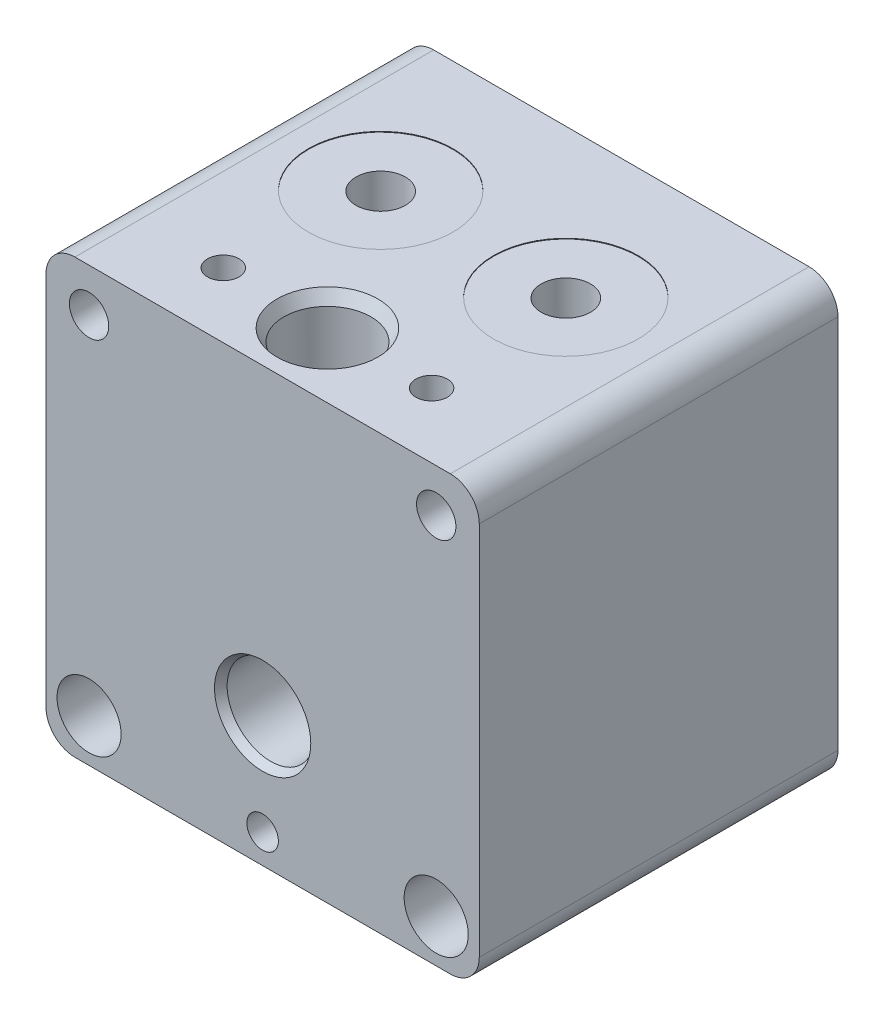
from build123d import *

# Parameters (mm, degrees)
BASE_EXTRUDE_DEPTH       = 39.37
FILLET2_R                = 3.175
SKETCH19_R               = 1.7272
F_8_32_HOLES_DEPTH       = 7.62
SKETCH3_R                = 2.159
CORNER_THRU_HOLES_DEPTH  = 52.772976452
SKETCH4_R                = 3.5179
CORNER_CBORE_DEPTH       = 7.62
SKETCH10_R               = 3.2385
SENSORS_THRU_HOLES_DEPTH = 52.772976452
SKETCH13_R               = 4.7752
TEMP_CBORE_DEPTH         = 11.684
SKETCH15_R               = 17.399
CAVITY_CBORE_DEPTH       = 22.352
SKETCH16_R               = 17.4625
BORE_ORING_DEPTH         = 12.7
CHAMFER2_SIZE            = 0.508
CHAMFER2_SIZE2           = 0.87988181
SKETCH23_R               = 2.7051
UW_CONN_THRU_DEPTH       = 22.86
SKETCH24_R               = 7.9375
UW_SPOTFACE_DEPTH        = 0.0762
SKETCH28_R               = 3.175
COND_RA_DRILL_DEPTH      = 12.7
SKETCH29_R               = 2.7051
UW2_THRU_DEPTH           = 22.86
SKETCH30_R               = 7.9375
UW2_LAND_DEPTH           = 0.0762
SKETCH31_R               = 1.7272
CND_KEEPER_HOLES_DEPTH   = 12.7
SKETCH32_R               = 2.413
CND_THRU_HOLE_DEPTH      = 20.32
SKETCH33_R               = 4.7752
CND_CBORE_DEPTH          = 13.716
CND_CHAMFER_SIZE         = 0.762
CND_CHAMFER_SIZE2        = 1.319822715
SKETCH34_R               = 21.336
ENDCAP_LAND_DEPTH        = 3.81
ENDCAP_CHAMFER_SIZE      = 0.508
ENDCAP_CHAMFER_SIZE2     = 0.87988181
SKETCH35_R               = 2.159
AFT_GUARD_HOLES_DEPTH    = 31.75
SKETCH36_R               = 1.1303
PLATE_HOLES_DEPTH        = 30.48


with BuildPart() as part:
    # Sketch1 → Base-Extrude (new body)
    with BuildSketch(Plane.XY):
        Polygon((23.7744, 0), (23.7744, 23.7744), (-23.7744, 23.7744), (-23.7744, -23.7744), (23.7744, -23.7744), align=None)
    extrude(amount=BASE_EXTRUDE_DEPTH)

    # Fillet2
    fillet2_edges = [part.edges().sort_by_distance(p)[0] for p in [
        (23.7744, -23.7744, 19.685),
        (-23.7744, -23.7744, 19.685),
        (-23.7744, 23.7744, 19.685),
        (23.7744, 23.7744, 19.685),
    ]]
    fillet(fillet2_edges, radius=FILLET2_R)

    # Sketch19 → 8_32_holes (cut)
    with BuildSketch(Plane.XY.offset(39.37)):
        with Locations((0, -20.574)):
            Circle(SKETCH19_R)
    extrude(amount=-F_8_32_HOLES_DEPTH, mode=Mode.SUBTRACT)

    # Sketch3 → corner_thru_holes (cut, through all)
    with BuildSketch(Plane.XY.offset(39.37)):
        with Locations((-19.05, -19.05)):
            Circle(SKETCH3_R)
        with Locations(Location((19.05, -19.05, 0), (0, 0, 180))):
            Circle(SKETCH3_R)
    extrude(amount=-CORNER_THRU_HOLES_DEPTH, mode=Mode.SUBTRACT)

    # Sketch4 → corner_cbore (cut)
    with BuildSketch(Plane.XY.offset(39.37)):
        with Locations((-19.05, -19.05)):
            Circle(SKETCH4_R)
        with Locations((19.05, -19.05)):
            Circle(SKETCH4_R)
    extrude(amount=-CORNER_CBORE_DEPTH, mode=Mode.SUBTRACT)

    # Sketch10 → sensors_thru_holes (cut, through all)
    with BuildSketch(Plane.XY.offset(39.37)):
        with Locations(Location((0, -9.525, 0), (0, 0, 180))):
            Circle(SKETCH10_R)
    extrude(amount=-SENSORS_THRU_HOLES_DEPTH, mode=Mode.SUBTRACT)

    # Sketch13 → temp_cbore (cut)
    with BuildSketch(Plane.XY.offset(39.37)):
        with Locations((0, -9.525)):
            Circle(SKETCH13_R)
    extrude(amount=-TEMP_CBORE_DEPTH, mode=Mode.SUBTRACT)

    # Sketch15 → cavity_cbore (cut)
    with BuildSketch(Plane(origin=(0, 0, 0), x_dir=(-1, 0, 0), z_dir=(0, 0, -1))):
        Circle(SKETCH15_R)
    extrude(amount=-CAVITY_CBORE_DEPTH, mode=Mode.SUBTRACT)

    # Sketch16 → bore_oring (cut)
    with BuildSketch(Plane(origin=(0, 0, 0), x_dir=(-1, 0, 0), z_dir=(0, 0, -1))):
        Circle(SKETCH16_R)
    extrude(amount=-BORE_ORING_DEPTH, mode=Mode.SUBTRACT)

    # Chamfer2
    chamfer2_edges = [part.edges().sort_by_distance(p)[0] for p in [
        (-4.7752, -9.525, 39.37),
    ]]
    chamfer2_side = [part.faces().sort_by_distance(p)[0] for p in [
        (0, 1.1256211, 39.37),
    ]]
    chamfer(chamfer2_edges, length=CHAMFER2_SIZE, length2=CHAMFER2_SIZE2, reference=chamfer2_side[0])

    # Sketch23 → uw_conn_thru (cut)
    with BuildSketch(Plane(origin=(0, 23.7744, 0), x_dir=(-1, 0, 0), z_dir=(0, 1, 0))):
        with Locations((10.16, 16.256)):
            Circle(SKETCH23_R)
    extrude(amount=-UW_CONN_THRU_DEPTH, mode=Mode.SUBTRACT)

    # Sketch24 → uw_spotface (cut)
    with BuildSketch(Plane(origin=(0, 23.7744, 0), x_dir=(-1, 0, 0), z_dir=(0, 1, 0))):
        with Locations((10.16, 16.256)):
            Circle(SKETCH24_R)
    extrude(amount=-UW_SPOTFACE_DEPTH, mode=Mode.SUBTRACT)

    # Sketch28 → cond_ra_drill (cut)
    with BuildSketch(Plane(origin=(0, 0, 22.352), x_dir=(-1, 0, 0), z_dir=(0, 0, -1))):
        with Locations((0, 2.54)):
            Circle(SKETCH28_R)
    extrude(amount=-COND_RA_DRILL_DEPTH, mode=Mode.SUBTRACT)

    # Sketch29 → uw2_thru (cut)
    with BuildSketch(Plane(origin=(0, 23.7744, 0), x_dir=(-1, 0, 0), z_dir=(0, 1, 0))):
        with Locations((-10.16, 16.256)):
            Circle(SKETCH29_R)
    extrude(amount=-UW2_THRU_DEPTH, mode=Mode.SUBTRACT)

    # Sketch30 → uw2_land (cut)
    with BuildSketch(Plane(origin=(0, 23.7744, 0), x_dir=(-1, 0, 0), z_dir=(0, 1, 0))):
        with Locations((-10.16, 16.256)):
            Circle(SKETCH30_R)
    extrude(amount=-UW2_LAND_DEPTH, mode=Mode.SUBTRACT)

    # Sketch31 → cnd_keeper_holes (cut)
    with BuildSketch(Plane(origin=(0, 23.7744, 0), x_dir=(-1, 0, 0), z_dir=(0, 1, 0))):
        with Locations((11.43, 32.258)):
            Circle(SKETCH31_R)
        with Locations(Location((-11.43, 32.258, 0), (0, 0, 180))):
            Circle(SKETCH31_R)
    extrude(amount=-CND_KEEPER_HOLES_DEPTH, mode=Mode.SUBTRACT)

    # Sketch32 → cnd_thru_hole (cut)
    with BuildSketch(Plane(origin=(0, 23.7744, 0), x_dir=(-1, 0, 0), z_dir=(0, 1, 0))):
        with Locations((0, 32.258)):
            Circle(SKETCH32_R)
    extrude(amount=-CND_THRU_HOLE_DEPTH, mode=Mode.SUBTRACT)

    # Sketch33 → cnd_cbore (cut)
    with BuildSketch(Plane(origin=(0, 23.7744, 0), x_dir=(-1, 0, 0), z_dir=(0, 1, 0))):
        with Locations((0, 32.258)):
            Circle(SKETCH33_R)
    extrude(amount=-CND_CBORE_DEPTH, mode=Mode.SUBTRACT)

    # cnd_chamfer
    cnd_chamfer_edges = [part.edges().sort_by_distance(p)[0] for p in [
        (4.7752, 23.7744, 32.258),
    ]]
    cnd_chamfer_side = [part.faces().sort_by_distance(p)[0] for p in [
        (0, 23.7744, 19.879645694),
    ]]
    chamfer(cnd_chamfer_edges, length=CND_CHAMFER_SIZE, length2=CND_CHAMFER_SIZE2, reference=cnd_chamfer_side[0])

    # Sketch34 → endcap_land (cut)
    with BuildSketch(Plane(origin=(0, 0, 0), x_dir=(-1, 0, 0), z_dir=(0, 0, -1))):
        Circle(SKETCH34_R)
    extrude(amount=-ENDCAP_LAND_DEPTH, mode=Mode.SUBTRACT)

    # endcap_chamfer
    endcap_chamfer_edges = [part.edges().sort_by_distance(p)[0] for p in [
        (17.4625, 0, 3.81),
    ]]
    endcap_chamfer_side = [part.faces().sort_by_distance(p)[0] for p in [
        (20.732526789, 0, 3.81),
    ]]
    chamfer(endcap_chamfer_edges, length=ENDCAP_CHAMFER_SIZE, length2=ENDCAP_CHAMFER_SIZE2, reference=endcap_chamfer_side[0])

    # Sketch35 → aft_guard_holes (cut)
    with BuildSketch(Plane.XY.offset(39.37)):
        with Locations((19.05, 19.05)):
            Circle(SKETCH35_R)
        with Locations(Location((-19.05, 19.05, 0), (0, 0, 180))):
            Circle(SKETCH35_R)
    extrude(amount=-AFT_GUARD_HOLES_DEPTH, mode=Mode.SUBTRACT)

    # Sketch36 → plate_holes (cut)
    with BuildSketch(Plane(origin=(0, 0, 0), x_dir=(-1, 0, 0), z_dir=(0, 0, -1))):
        with Locations((19.05, 19.05)):
            Circle(SKETCH36_R)
        with Locations((-19.05, 19.05)):
            Circle(SKETCH36_R)
    extrude(amount=-PLATE_HOLES_DEPTH, mode=Mode.SUBTRACT)


solid = part.part
